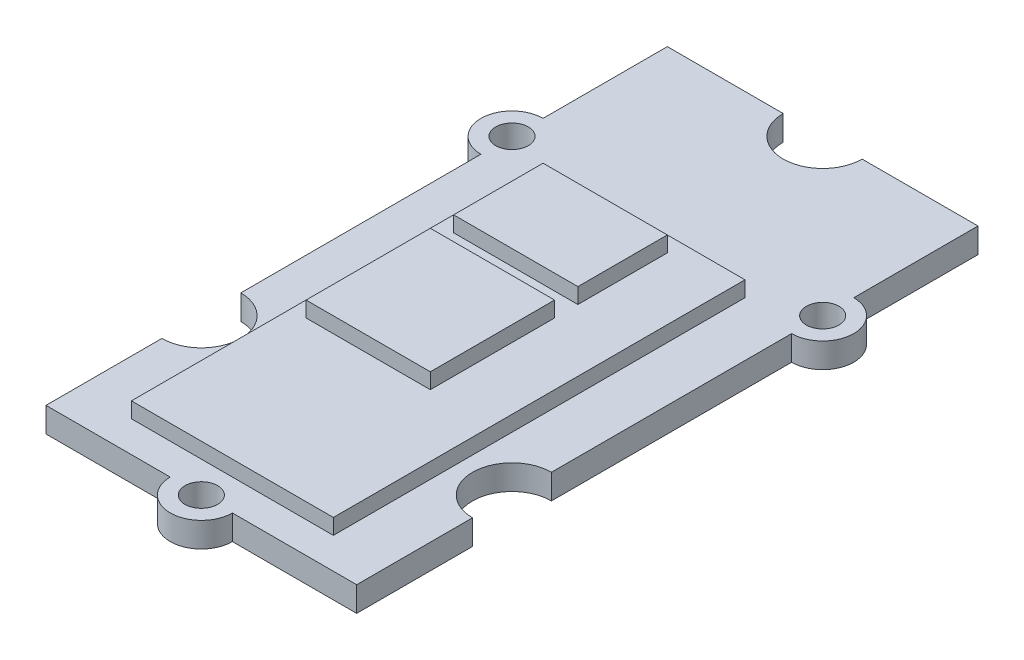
ISO-10303-21;
HEADER;
FILE_DESCRIPTION(('STEP AP214'),'2;1');
FILE_NAME('part.step','',(''),(''),'','','');
FILE_SCHEMA(('AUTOMOTIVE_DESIGN { 1 0 10303 214 1 1 1 1 }'));
ENDSEC;
DATA;
#1=APPLICATION_CONTEXT('core data for automotive mechanical design processes');
#2=APPLICATION_PROTOCOL_DEFINITION('international standard','automotive_design',2000,#1);
#3=PRODUCT_CONTEXT('',#1,'mechanical');
#4=PRODUCT('Part','Part','',(#3));
#5=PRODUCT_RELATED_PRODUCT_CATEGORY('part','',(#4));
#6=PRODUCT_DEFINITION_FORMATION('','',#4);
#7=PRODUCT_DEFINITION_CONTEXT('part definition',#1,'design');
#8=PRODUCT_DEFINITION('design','',#6,#7);
#9=PRODUCT_DEFINITION_SHAPE('','',#8);
#10=(LENGTH_UNIT() NAMED_UNIT(*) SI_UNIT(.MILLI.,.METRE.));
#11=(NAMED_UNIT(*) PLANE_ANGLE_UNIT() SI_UNIT($,.RADIAN.));
#12=(NAMED_UNIT(*) SI_UNIT($,.STERADIAN.) SOLID_ANGLE_UNIT());
#13=UNCERTAINTY_MEASURE_WITH_UNIT(LENGTH_MEASURE(1.E-05),#10,'distance_accuracy_value','');
#14=(GEOMETRIC_REPRESENTATION_CONTEXT(3) GLOBAL_UNCERTAINTY_ASSIGNED_CONTEXT((#13)) GLOBAL_UNIT_ASSIGNED_CONTEXT((#10,
#11,#12)) REPRESENTATION_CONTEXT('',''));
#15=CARTESIAN_POINT('',(0.,0.,0.));
#16=DIRECTION('',(0.,0.,1.));
#17=DIRECTION('',(1.,0.,0.));
#18=AXIS2_PLACEMENT_3D('',#15,#16,#17);
#19=CARTESIAN_POINT('',(0.,2.6,0.));
#20=DIRECTION('',(0.,1.,0.));
#21=DIRECTION('',(0.,0.,1.));
#22=AXIS2_PLACEMENT_3D('',#19,#20,#21);
#23=PLANE('',#22);
#24=DIRECTION('',(0.,0.,-1.));
#25=VECTOR('',#24,1.);
#26=CARTESIAN_POINT('',(6.5,2.6,1.5));
#27=LINE('',#26,#25);
#28=CARTESIAN_POINT('',(6.5,2.6,28.));
#29=VERTEX_POINT('',#28);
#30=CARTESIAN_POINT('',(6.5,2.6,1.5));
#31=VERTEX_POINT('',#30);
#32=EDGE_CURVE('E278',#29,#31,#27,.T.);
#33=ORIENTED_EDGE('',*,*,#32,.T.);
#34=DIRECTION('',(-1.,0.,0.));
#35=VECTOR('',#34,1.);
#36=CARTESIAN_POINT('',(-6.5,2.6,1.5));
#37=LINE('',#36,#35);
#38=CARTESIAN_POINT('',(-6.5,2.6,1.5));
#39=VERTEX_POINT('',#38);
#40=EDGE_CURVE('E281',#31,#39,#37,.T.);
#41=ORIENTED_EDGE('',*,*,#40,.T.);
#42=DIRECTION('',(0.,0.,1.));
#43=VECTOR('',#42,1.);
#44=CARTESIAN_POINT('',(-6.5,2.6,1.5));
#45=LINE('',#44,#43);
#46=CARTESIAN_POINT('',(-6.5,2.6,28.));
#47=VERTEX_POINT('',#46);
#48=EDGE_CURVE('E284',#39,#47,#45,.T.);
#49=ORIENTED_EDGE('',*,*,#48,.T.);
#50=DIRECTION('',(1.,0.,0.));
#51=VECTOR('',#50,1.);
#52=CARTESIAN_POINT('',(-6.5,2.6,28.));
#53=LINE('',#52,#51);
#54=EDGE_CURVE('E286',#47,#29,#53,.T.);
#55=ORIENTED_EDGE('',*,*,#54,.T.);
#56=EDGE_LOOP('',(#33,#41,#49,#55));
#57=FACE_BOUND('',#56,.T.);
#58=DIRECTION('',(1.,0.,0.));
#59=VECTOR('',#58,1.);
#60=CARTESIAN_POINT('',(-5.5,2.6,8.25839974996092));
#61=LINE('',#60,#59);
#62=CARTESIAN_POINT('',(-5.5,2.6,8.25839974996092));
#63=VERTEX_POINT('',#62);
#64=CARTESIAN_POINT('',(2.5,2.6,8.25839974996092));
#65=VERTEX_POINT('',#64);
#66=EDGE_CURVE('E249',#63,#65,#61,.T.);
#67=ORIENTED_EDGE('',*,*,#66,.F.);
#68=DIRECTION('',(0.,0.,1.));
#69=VECTOR('',#68,1.);
#70=CARTESIAN_POINT('',(-5.5,2.6,2.5));
#71=LINE('',#70,#69);
#72=CARTESIAN_POINT('',(-5.5,2.6,2.5));
#73=VERTEX_POINT('',#72);
#74=EDGE_CURVE('E246',#73,#63,#71,.T.);
#75=ORIENTED_EDGE('',*,*,#74,.F.);
#76=DIRECTION('',(-1.,0.,0.));
#77=VECTOR('',#76,1.);
#78=CARTESIAN_POINT('',(-5.5,2.6,2.5));
#79=LINE('',#78,#77);
#80=CARTESIAN_POINT('',(2.5,2.6,2.5));
#81=VERTEX_POINT('',#80);
#82=EDGE_CURVE('E258',#81,#73,#79,.T.);
#83=ORIENTED_EDGE('',*,*,#82,.F.);
#84=DIRECTION('',(0.,0.,-1.));
#85=VECTOR('',#84,1.);
#86=CARTESIAN_POINT('',(2.5,2.6,2.5));
#87=LINE('',#86,#85);
#88=EDGE_CURVE('E266',#65,#81,#87,.T.);
#89=ORIENTED_EDGE('',*,*,#88,.F.);
#90=EDGE_LOOP('',(#67,#75,#83,#89));
#91=FACE_BOUND('',#90,.T.);
#92=DIRECTION('',(1.,0.,0.));
#93=VECTOR('',#92,1.);
#94=CARTESIAN_POINT('',(-5.5,2.6,17.7583997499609));
#95=LINE('',#94,#93);
#96=CARTESIAN_POINT('',(-5.5,2.6,17.7583997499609));
#97=VERTEX_POINT('',#96);
#98=CARTESIAN_POINT('',(2.5,2.6,17.7583997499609));
#99=VERTEX_POINT('',#98);
#100=EDGE_CURVE('E766',#97,#99,#95,.T.);
#101=ORIENTED_EDGE('',*,*,#100,.F.);
#102=DIRECTION('',(0.,0.,1.));
#103=VECTOR('',#102,1.);
#104=CARTESIAN_POINT('',(-5.5,2.6,9.75839974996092));
#105=LINE('',#104,#103);
#106=CARTESIAN_POINT('',(-5.5,2.6,9.75839974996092));
#107=VERTEX_POINT('',#106);
#108=EDGE_CURVE('E244',#107,#97,#105,.T.);
#109=ORIENTED_EDGE('',*,*,#108,.F.);
#110=DIRECTION('',(-1.,0.,0.));
#111=VECTOR('',#110,1.);
#112=CARTESIAN_POINT('',(-5.5,2.6,9.75839974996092));
#113=LINE('',#112,#111);
#114=CARTESIAN_POINT('',(2.5,2.6,9.75839974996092));
#115=VERTEX_POINT('',#114);
#116=EDGE_CURVE('E240',#115,#107,#113,.T.);
#117=ORIENTED_EDGE('',*,*,#116,.F.);
#118=DIRECTION('',(0.,0.,-1.));
#119=VECTOR('',#118,1.);
#120=CARTESIAN_POINT('',(2.5,2.6,9.75839974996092));
#121=LINE('',#120,#119);
#122=EDGE_CURVE('E763',#99,#115,#121,.T.);
#123=ORIENTED_EDGE('',*,*,#122,.F.);
#124=EDGE_LOOP('',(#101,#109,#117,#123));
#125=FACE_BOUND('',#124,.T.);
#126=ADVANCED_FACE('F35',(#57,#91,#125),#23,.T.);
#127=CARTESIAN_POINT('',(-10.,1.6,0.));
#128=DIRECTION('',(0.,-1.,0.));
#129=DIRECTION('',(0.,0.,-1.));
#130=AXIS2_PLACEMENT_3D('',#127,#128,#129);
#131=PLANE('',#130);
#132=CARTESIAN_POINT('',(0.,1.6,30.));
#133=DIRECTION('',(0.,1.,0.));
#134=DIRECTION('',(0.,0.,1.));
#135=AXIS2_PLACEMENT_3D('',#132,#133,#134);
#136=CIRCLE('',#135,1.05);
#137=CARTESIAN_POINT('',(0.,1.6,31.05));
#138=VERTEX_POINT('',#137);
#139=EDGE_CURVE('E311',#138,#138,#136,.T.);
#140=ORIENTED_EDGE('',*,*,#139,.F.);
#141=EDGE_LOOP('',(#140));
#142=FACE_BOUND('',#141,.T.);
#143=CARTESIAN_POINT('',(-10.,1.6,0.));
#144=DIRECTION('',(0.,1.,0.));
#145=DIRECTION('',(0.,0.,-1.));
#146=AXIS2_PLACEMENT_3D('',#143,#144,#145);
#147=CIRCLE('',#146,1.05);
#148=CARTESIAN_POINT('',(-10.,1.6,-1.04999999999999));
#149=VERTEX_POINT('',#148);
#150=EDGE_CURVE('E317',#149,#149,#147,.T.);
#151=ORIENTED_EDGE('',*,*,#150,.F.);
#152=EDGE_LOOP('',(#151));
#153=FACE_BOUND('',#152,.T.);
#154=CARTESIAN_POINT('',(10.,1.6,0.));
#155=DIRECTION('',(0.,1.,0.));
#156=DIRECTION('',(0.,0.,1.));
#157=AXIS2_PLACEMENT_3D('',#154,#155,#156);
#158=CIRCLE('',#157,1.05);
#159=CARTESIAN_POINT('',(10.,1.6,1.05000000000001));
#160=VERTEX_POINT('',#159);
#161=EDGE_CURVE('E323',#160,#160,#158,.T.);
#162=ORIENTED_EDGE('',*,*,#161,.F.);
#163=EDGE_LOOP('',(#162));
#164=FACE_BOUND('',#163,.T.);
#165=DIRECTION('',(0.,0.,1.));
#166=VECTOR('',#165,1.);
#167=CARTESIAN_POINT('',(-10.,1.6,-9.99999999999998));
#168=LINE('',#167,#166);
#169=CARTESIAN_POINT('',(-10.,1.6,-9.99999999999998));
#170=VERTEX_POINT('',#169);
#171=CARTESIAN_POINT('',(-10.,1.6,-1.99999999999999));
#172=VERTEX_POINT('',#171);
#173=EDGE_CURVE('E329',#170,#172,#168,.T.);
#174=ORIENTED_EDGE('',*,*,#173,.T.);
#175=CARTESIAN_POINT('',(-10.,1.6,0.));
#176=DIRECTION('',(0.,1.,0.));
#177=DIRECTION('',(0.,0.,-1.));
#178=AXIS2_PLACEMENT_3D('',#175,#176,#177);
#179=CIRCLE('',#178,2.);
#180=CARTESIAN_POINT('',(-10.,1.6,2.00000000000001));
#181=VERTEX_POINT('',#180);
#182=EDGE_CURVE('E332',#172,#181,#179,.T.);
#183=ORIENTED_EDGE('',*,*,#182,.T.);
#184=DIRECTION('',(0.,0.,1.));
#185=VECTOR('',#184,1.);
#186=CARTESIAN_POINT('',(-10.,1.6,2.00000000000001));
#187=LINE('',#186,#185);
#188=CARTESIAN_POINT('',(-10.,1.6,17.46));
#189=VERTEX_POINT('',#188);
#190=EDGE_CURVE('E335',#181,#189,#187,.T.);
#191=ORIENTED_EDGE('',*,*,#190,.T.);
#192=CARTESIAN_POINT('',(-10.,1.6,20.));
#193=DIRECTION('',(0.,-1.,0.));
#194=DIRECTION('',(0.,0.,-1.));
#195=AXIS2_PLACEMENT_3D('',#192,#193,#194);
#196=CIRCLE('',#195,2.54);
#197=CARTESIAN_POINT('',(-10.,1.6,22.54));
#198=VERTEX_POINT('',#197);
#199=EDGE_CURVE('E337',#189,#198,#196,.T.);
#200=ORIENTED_EDGE('',*,*,#199,.T.);
#201=DIRECTION('',(0.,0.,1.));
#202=VECTOR('',#201,1.);
#203=CARTESIAN_POINT('',(-10.,1.6,22.54));
#204=LINE('',#203,#202);
#205=CARTESIAN_POINT('',(-10.,1.6,30.));
#206=VERTEX_POINT('',#205);
#207=EDGE_CURVE('E339',#198,#206,#204,.T.);
#208=ORIENTED_EDGE('',*,*,#207,.T.);
#209=DIRECTION('',(1.,0.,0.));
#210=VECTOR('',#209,1.);
#211=CARTESIAN_POINT('',(-10.,1.6,30.));
#212=LINE('',#211,#210);
#213=CARTESIAN_POINT('',(-2.,1.6,30.));
#214=VERTEX_POINT('',#213);
#215=EDGE_CURVE('E341',#206,#214,#212,.T.);
#216=ORIENTED_EDGE('',*,*,#215,.T.);
#217=CARTESIAN_POINT('',(0.,1.6,30.));
#218=DIRECTION('',(0.,1.,0.));
#219=DIRECTION('',(0.,0.,1.));
#220=AXIS2_PLACEMENT_3D('',#217,#218,#219);
#221=CIRCLE('',#220,2.);
#222=CARTESIAN_POINT('',(2.,1.6,30.));
#223=VERTEX_POINT('',#222);
#224=EDGE_CURVE('E343',#214,#223,#221,.T.);
#225=ORIENTED_EDGE('',*,*,#224,.T.);
#226=DIRECTION('',(1.,0.,0.));
#227=VECTOR('',#226,1.);
#228=CARTESIAN_POINT('',(2.,1.6,30.));
#229=LINE('',#228,#227);
#230=CARTESIAN_POINT('',(10.,1.6,30.));
#231=VERTEX_POINT('',#230);
#232=EDGE_CURVE('E345',#223,#231,#229,.T.);
#233=ORIENTED_EDGE('',*,*,#232,.T.);
#234=DIRECTION('',(0.,0.,-1.));
#235=VECTOR('',#234,1.);
#236=CARTESIAN_POINT('',(10.,1.6,22.54));
#237=LINE('',#236,#235);
#238=CARTESIAN_POINT('',(10.,1.6,22.54));
#239=VERTEX_POINT('',#238);
#240=EDGE_CURVE('E347',#231,#239,#237,.T.);
#241=ORIENTED_EDGE('',*,*,#240,.T.);
#242=CARTESIAN_POINT('',(10.,1.6,20.));
#243=DIRECTION('',(0.,-1.,0.));
#244=DIRECTION('',(0.,0.,1.));
#245=AXIS2_PLACEMENT_3D('',#242,#243,#244);
#246=CIRCLE('',#245,2.54);
#247=CARTESIAN_POINT('',(10.,1.6,17.46));
#248=VERTEX_POINT('',#247);
#249=EDGE_CURVE('E349',#239,#248,#246,.T.);
#250=ORIENTED_EDGE('',*,*,#249,.T.);
#251=DIRECTION('',(0.,0.,-1.));
#252=VECTOR('',#251,1.);
#253=CARTESIAN_POINT('',(10.,1.6,2.00000000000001));
#254=LINE('',#253,#252);
#255=CARTESIAN_POINT('',(10.,1.6,2.00000000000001));
#256=VERTEX_POINT('',#255);
#257=EDGE_CURVE('E351',#248,#256,#254,.T.);
#258=ORIENTED_EDGE('',*,*,#257,.T.);
#259=CARTESIAN_POINT('',(10.,1.6,0.));
#260=DIRECTION('',(0.,1.,0.));
#261=DIRECTION('',(0.,0.,1.));
#262=AXIS2_PLACEMENT_3D('',#259,#260,#261);
#263=CIRCLE('',#262,2.);
#264=CARTESIAN_POINT('',(10.,1.6,-1.99999999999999));
#265=VERTEX_POINT('',#264);
#266=EDGE_CURVE('E353',#256,#265,#263,.T.);
#267=ORIENTED_EDGE('',*,*,#266,.T.);
#268=DIRECTION('',(0.,0.,-1.));
#269=VECTOR('',#268,1.);
#270=CARTESIAN_POINT('',(10.,1.6,-9.99999999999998));
#271=LINE('',#270,#269);
#272=CARTESIAN_POINT('',(10.,1.6,-9.99999999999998));
#273=VERTEX_POINT('',#272);
#274=EDGE_CURVE('E355',#265,#273,#271,.T.);
#275=ORIENTED_EDGE('',*,*,#274,.T.);
#276=DIRECTION('',(-1.,0.,0.));
#277=VECTOR('',#276,1.);
#278=CARTESIAN_POINT('',(2.54,1.6,-9.99999999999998));
#279=LINE('',#278,#277);
#280=CARTESIAN_POINT('',(2.54,1.6,-9.99999999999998));
#281=VERTEX_POINT('',#280);
#282=EDGE_CURVE('E357',#273,#281,#279,.T.);
#283=ORIENTED_EDGE('',*,*,#282,.T.);
#284=CARTESIAN_POINT('',(0.,1.6,-9.99999999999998));
#285=DIRECTION('',(0.,-1.,0.));
#286=DIRECTION('',(0.,0.,1.));
#287=AXIS2_PLACEMENT_3D('',#284,#285,#286);
#288=CIRCLE('',#287,2.54);
#289=CARTESIAN_POINT('',(-2.54,1.6,-9.99999999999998));
#290=VERTEX_POINT('',#289);
#291=EDGE_CURVE('E359',#281,#290,#288,.T.);
#292=ORIENTED_EDGE('',*,*,#291,.T.);
#293=DIRECTION('',(-1.,0.,0.));
#294=VECTOR('',#293,1.);
#295=CARTESIAN_POINT('',(-10.,1.6,-9.99999999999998));
#296=LINE('',#295,#294);
#297=EDGE_CURVE('E361',#290,#170,#296,.T.);
#298=ORIENTED_EDGE('',*,*,#297,.T.);
#299=EDGE_LOOP('',(#174,#183,#191,#200,#208,#216,#225,#233,#241,#250,#258,#267,#275,#283,#292,#298));
#300=FACE_BOUND('',#299,.T.);
#301=DIRECTION('',(0.,0.,-1.));
#302=VECTOR('',#301,1.);
#303=CARTESIAN_POINT('',(6.5,1.6,1.5));
#304=LINE('',#303,#302);
#305=CARTESIAN_POINT('',(6.5,1.6,28.));
#306=VERTEX_POINT('',#305);
#307=CARTESIAN_POINT('',(6.5,1.6,1.5));
#308=VERTEX_POINT('',#307);
#309=EDGE_CURVE('E277',#306,#308,#304,.T.);
#310=ORIENTED_EDGE('',*,*,#309,.F.);
#311=DIRECTION('',(1.,0.,0.));
#312=VECTOR('',#311,1.);
#313=CARTESIAN_POINT('',(-6.5,1.6,28.));
#314=LINE('',#313,#312);
#315=CARTESIAN_POINT('',(-6.5,1.6,28.));
#316=VERTEX_POINT('',#315);
#317=EDGE_CURVE('E282',#316,#306,#314,.T.);
#318=ORIENTED_EDGE('',*,*,#317,.F.);
#319=DIRECTION('',(0.,0.,1.));
#320=VECTOR('',#319,1.);
#321=CARTESIAN_POINT('',(-6.5,1.6,1.5));
#322=LINE('',#321,#320);
#323=CARTESIAN_POINT('',(-6.5,1.6,1.5));
#324=VERTEX_POINT('',#323);
#325=EDGE_CURVE('E294',#324,#316,#322,.T.);
#326=ORIENTED_EDGE('',*,*,#325,.F.);
#327=DIRECTION('',(-1.,0.,0.));
#328=VECTOR('',#327,1.);
#329=CARTESIAN_POINT('',(-6.5,1.6,1.5));
#330=LINE('',#329,#328);
#331=EDGE_CURVE('E291',#308,#324,#330,.T.);
#332=ORIENTED_EDGE('',*,*,#331,.F.);
#333=EDGE_LOOP('',(#310,#318,#326,#332));
#334=FACE_BOUND('',#333,.T.);
#335=ADVANCED_FACE('F460',(#142,#153,#164,#300,#334),#131,.F.);
#336=CARTESIAN_POINT('',(-10.,0.,0.));
#337=DIRECTION('',(0.,-1.,0.));
#338=DIRECTION('',(0.,0.,-1.));
#339=AXIS2_PLACEMENT_3D('',#336,#337,#338);
#340=PLANE('',#339);
#341=CARTESIAN_POINT('',(-10.,0.,0.));
#342=DIRECTION('',(0.,1.,0.));
#343=DIRECTION('',(0.,0.,-1.));
#344=AXIS2_PLACEMENT_3D('',#341,#342,#343);
#345=CIRCLE('',#344,1.05);
#346=CARTESIAN_POINT('',(-10.,0.,-1.04999999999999));
#347=VERTEX_POINT('',#346);
#348=EDGE_CURVE('E314',#347,#347,#345,.T.);
#349=ORIENTED_EDGE('',*,*,#348,.T.);
#350=EDGE_LOOP('',(#349));
#351=FACE_BOUND('',#350,.T.);
#352=DIRECTION('',(0.,0.,1.));
#353=VECTOR('',#352,1.);
#354=CARTESIAN_POINT('',(-10.,0.,-9.99999999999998));
#355=LINE('',#354,#353);
#356=CARTESIAN_POINT('',(-10.,0.,-9.99999999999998));
#357=VERTEX_POINT('',#356);
#358=CARTESIAN_POINT('',(-10.,0.,-1.99999999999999));
#359=VERTEX_POINT('',#358);
#360=EDGE_CURVE('E326',#357,#359,#355,.T.);
#361=ORIENTED_EDGE('',*,*,#360,.F.);
#362=DIRECTION('',(-1.,0.,0.));
#363=VECTOR('',#362,1.);
#364=CARTESIAN_POINT('',(-10.,0.,-9.99999999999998));
#365=LINE('',#364,#363);
#366=CARTESIAN_POINT('',(-2.54,0.,-9.99999999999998));
#367=VERTEX_POINT('',#366);
#368=EDGE_CURVE('E333',#367,#357,#365,.T.);
#369=ORIENTED_EDGE('',*,*,#368,.F.);
#370=CARTESIAN_POINT('',(0.,0.,-9.99999999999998));
#371=DIRECTION('',(0.,-1.,0.));
#372=DIRECTION('',(0.,0.,1.));
#373=AXIS2_PLACEMENT_3D('',#370,#371,#372);
#374=CIRCLE('',#373,2.54);
#375=CARTESIAN_POINT('',(2.54,0.,-9.99999999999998));
#376=VERTEX_POINT('',#375);
#377=EDGE_CURVE('E392',#376,#367,#374,.T.);
#378=ORIENTED_EDGE('',*,*,#377,.F.);
#379=DIRECTION('',(-1.,0.,0.));
#380=VECTOR('',#379,1.);
#381=CARTESIAN_POINT('',(2.54,0.,-9.99999999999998));
#382=LINE('',#381,#380);
#383=CARTESIAN_POINT('',(10.,0.,-9.99999999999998));
#384=VERTEX_POINT('',#383);
#385=EDGE_CURVE('E390',#384,#376,#382,.T.);
#386=ORIENTED_EDGE('',*,*,#385,.F.);
#387=DIRECTION('',(0.,0.,-1.));
#388=VECTOR('',#387,1.);
#389=CARTESIAN_POINT('',(10.,0.,-9.99999999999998));
#390=LINE('',#389,#388);
#391=CARTESIAN_POINT('',(10.,0.,-1.99999999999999));
#392=VERTEX_POINT('',#391);
#393=EDGE_CURVE('E388',#392,#384,#390,.T.);
#394=ORIENTED_EDGE('',*,*,#393,.F.);
#395=CARTESIAN_POINT('',(10.,0.,0.));
#396=DIRECTION('',(0.,1.,0.));
#397=DIRECTION('',(0.,0.,1.));
#398=AXIS2_PLACEMENT_3D('',#395,#396,#397);
#399=CIRCLE('',#398,2.);
#400=CARTESIAN_POINT('',(10.,0.,2.00000000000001));
#401=VERTEX_POINT('',#400);
#402=EDGE_CURVE('E386',#401,#392,#399,.T.);
#403=ORIENTED_EDGE('',*,*,#402,.F.);
#404=DIRECTION('',(0.,0.,-1.));
#405=VECTOR('',#404,1.);
#406=CARTESIAN_POINT('',(10.,0.,2.00000000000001));
#407=LINE('',#406,#405);
#408=CARTESIAN_POINT('',(10.,0.,17.46));
#409=VERTEX_POINT('',#408);
#410=EDGE_CURVE('E384',#409,#401,#407,.T.);
#411=ORIENTED_EDGE('',*,*,#410,.F.);
#412=CARTESIAN_POINT('',(10.,0.,20.));
#413=DIRECTION('',(0.,-1.,0.));
#414=DIRECTION('',(0.,0.,1.));
#415=AXIS2_PLACEMENT_3D('',#412,#413,#414);
#416=CIRCLE('',#415,2.54);
#417=CARTESIAN_POINT('',(10.,0.,22.54));
#418=VERTEX_POINT('',#417);
#419=EDGE_CURVE('E382',#418,#409,#416,.T.);
#420=ORIENTED_EDGE('',*,*,#419,.F.);
#421=DIRECTION('',(0.,0.,-1.));
#422=VECTOR('',#421,1.);
#423=CARTESIAN_POINT('',(10.,0.,22.54));
#424=LINE('',#423,#422);
#425=CARTESIAN_POINT('',(10.,0.,30.));
#426=VERTEX_POINT('',#425);
#427=EDGE_CURVE('E380',#426,#418,#424,.T.);
#428=ORIENTED_EDGE('',*,*,#427,.F.);
#429=DIRECTION('',(1.,0.,0.));
#430=VECTOR('',#429,1.);
#431=CARTESIAN_POINT('',(2.,0.,30.));
#432=LINE('',#431,#430);
#433=CARTESIAN_POINT('',(2.,0.,30.));
#434=VERTEX_POINT('',#433);
#435=EDGE_CURVE('E378',#434,#426,#432,.T.);
#436=ORIENTED_EDGE('',*,*,#435,.F.);
#437=CARTESIAN_POINT('',(0.,0.,30.));
#438=DIRECTION('',(0.,1.,0.));
#439=DIRECTION('',(0.,0.,1.));
#440=AXIS2_PLACEMENT_3D('',#437,#438,#439);
#441=CIRCLE('',#440,2.);
#442=CARTESIAN_POINT('',(-2.,0.,30.));
#443=VERTEX_POINT('',#442);
#444=EDGE_CURVE('E376',#443,#434,#441,.T.);
#445=ORIENTED_EDGE('',*,*,#444,.F.);
#446=DIRECTION('',(1.,0.,0.));
#447=VECTOR('',#446,1.);
#448=CARTESIAN_POINT('',(-10.,0.,30.));
#449=LINE('',#448,#447);
#450=CARTESIAN_POINT('',(-10.,0.,30.));
#451=VERTEX_POINT('',#450);
#452=EDGE_CURVE('E374',#451,#443,#449,.T.);
#453=ORIENTED_EDGE('',*,*,#452,.F.);
#454=DIRECTION('',(0.,0.,1.));
#455=VECTOR('',#454,1.);
#456=CARTESIAN_POINT('',(-10.,0.,22.54));
#457=LINE('',#456,#455);
#458=CARTESIAN_POINT('',(-10.,0.,22.54));
#459=VERTEX_POINT('',#458);
#460=EDGE_CURVE('E372',#459,#451,#457,.T.);
#461=ORIENTED_EDGE('',*,*,#460,.F.);
#462=CARTESIAN_POINT('',(-10.,0.,20.));
#463=DIRECTION('',(0.,-1.,0.));
#464=DIRECTION('',(0.,0.,-1.));
#465=AXIS2_PLACEMENT_3D('',#462,#463,#464);
#466=CIRCLE('',#465,2.54);
#467=CARTESIAN_POINT('',(-10.,0.,17.46));
#468=VERTEX_POINT('',#467);
#469=EDGE_CURVE('E370',#468,#459,#466,.T.);
#470=ORIENTED_EDGE('',*,*,#469,.F.);
#471=DIRECTION('',(0.,0.,1.));
#472=VECTOR('',#471,1.);
#473=CARTESIAN_POINT('',(-10.,0.,2.00000000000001));
#474=LINE('',#473,#472);
#475=CARTESIAN_POINT('',(-10.,0.,2.00000000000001));
#476=VERTEX_POINT('',#475);
#477=EDGE_CURVE('E368',#476,#468,#474,.T.);
#478=ORIENTED_EDGE('',*,*,#477,.F.);
#479=CARTESIAN_POINT('',(-10.,0.,0.));
#480=DIRECTION('',(0.,1.,0.));
#481=DIRECTION('',(0.,0.,-1.));
#482=AXIS2_PLACEMENT_3D('',#479,#480,#481);
#483=CIRCLE('',#482,2.);
#484=EDGE_CURVE('E366',#359,#476,#483,.T.);
#485=ORIENTED_EDGE('',*,*,#484,.F.);
#486=EDGE_LOOP('',(#361,#369,#378,#386,#394,#403,#411,#420,#428,#436,#445,#453,#461,#470,#478,#485));
#487=FACE_BOUND('',#486,.T.);
#488=CARTESIAN_POINT('',(10.,0.,0.));
#489=DIRECTION('',(0.,1.,0.));
#490=DIRECTION('',(0.,0.,1.));
#491=AXIS2_PLACEMENT_3D('',#488,#489,#490);
#492=CIRCLE('',#491,1.05);
#493=CARTESIAN_POINT('',(10.,0.,1.05000000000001));
#494=VERTEX_POINT('',#493);
#495=EDGE_CURVE('E320',#494,#494,#492,.T.);
#496=ORIENTED_EDGE('',*,*,#495,.T.);
#497=EDGE_LOOP('',(#496));
#498=FACE_BOUND('',#497,.T.);
#499=CARTESIAN_POINT('',(0.,0.,30.));
#500=DIRECTION('',(0.,1.,0.));
#501=DIRECTION('',(0.,0.,1.));
#502=AXIS2_PLACEMENT_3D('',#499,#500,#501);
#503=CIRCLE('',#502,1.05);
#504=CARTESIAN_POINT('',(0.,0.,31.05));
#505=VERTEX_POINT('',#504);
#506=EDGE_CURVE('E310',#505,#505,#503,.T.);
#507=ORIENTED_EDGE('',*,*,#506,.T.);
#508=EDGE_LOOP('',(#507));
#509=FACE_BOUND('',#508,.T.);
#510=ADVANCED_FACE('F446',(#351,#487,#498,#509),#340,.T.);
#511=CARTESIAN_POINT('',(-10.,1.6,-9.99999999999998));
#512=DIRECTION('',(1.,0.,0.));
#513=DIRECTION('',(0.,0.,-1.));
#514=AXIS2_PLACEMENT_3D('',#511,#512,#513);
#515=PLANE('',#514);
#516=ORIENTED_EDGE('',*,*,#360,.T.);
#517=DIRECTION('',(0.,-1.,0.));
#518=VECTOR('',#517,1.);
#519=CARTESIAN_POINT('',(-10.,1.6,-1.99999999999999));
#520=LINE('',#519,#518);
#521=EDGE_CURVE('E11',#172,#359,#520,.T.);
#522=ORIENTED_EDGE('',*,*,#521,.F.);
#523=ORIENTED_EDGE('',*,*,#173,.F.);
#524=DIRECTION('',(0.,-1.,0.));
#525=VECTOR('',#524,1.);
#526=CARTESIAN_POINT('',(-10.,1.6,-9.99999999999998));
#527=LINE('',#526,#525);
#528=EDGE_CURVE('E363',#170,#357,#527,.T.);
#529=ORIENTED_EDGE('',*,*,#528,.T.);
#530=EDGE_LOOP('',(#516,#522,#523,#529));
#531=FACE_BOUND('',#530,.T.);
#532=ADVANCED_FACE('F37',(#531),#515,.F.);
#533=CARTESIAN_POINT('',(-10.,1.6,0.));
#534=DIRECTION('',(0.,-1.,0.));
#535=DIRECTION('',(0.,0.,-1.));
#536=AXIS2_PLACEMENT_3D('',#533,#534,#535);
#537=CYLINDRICAL_SURFACE('',#536,2.);
#538=ORIENTED_EDGE('',*,*,#484,.T.);
#539=DIRECTION('',(0.,-1.,0.));
#540=VECTOR('',#539,1.);
#541=CARTESIAN_POINT('',(-10.,1.6,2.00000000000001));
#542=LINE('',#541,#540);
#543=EDGE_CURVE('E43',#181,#476,#542,.T.);
#544=ORIENTED_EDGE('',*,*,#543,.F.);
#545=ORIENTED_EDGE('',*,*,#182,.F.);
#546=ORIENTED_EDGE('',*,*,#521,.T.);
#547=EDGE_LOOP('',(#538,#544,#545,#546));
#548=FACE_BOUND('',#547,.T.);
#549=ADVANCED_FACE('F465',(#548),#537,.T.);
#550=CARTESIAN_POINT('',(-10.,1.6,2.00000000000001));
#551=DIRECTION('',(1.,0.,0.));
#552=DIRECTION('',(0.,0.,-1.));
#553=AXIS2_PLACEMENT_3D('',#550,#551,#552);
#554=PLANE('',#553);
#555=ORIENTED_EDGE('',*,*,#477,.T.);
#556=DIRECTION('',(0.,-1.,0.));
#557=VECTOR('',#556,1.);
#558=CARTESIAN_POINT('',(-10.,1.6,17.46));
#559=LINE('',#558,#557);
#560=EDGE_CURVE('E433',#189,#468,#559,.T.);
#561=ORIENTED_EDGE('',*,*,#560,.F.);
#562=ORIENTED_EDGE('',*,*,#190,.F.);
#563=ORIENTED_EDGE('',*,*,#543,.T.);
#564=EDGE_LOOP('',(#555,#561,#562,#563));
#565=FACE_BOUND('',#564,.T.);
#566=ADVANCED_FACE('F440',(#565),#554,.F.);
#567=CARTESIAN_POINT('',(-10.,1.6,20.));
#568=DIRECTION('',(0.,-1.,0.));
#569=DIRECTION('',(0.,0.,-1.));
#570=AXIS2_PLACEMENT_3D('',#567,#568,#569);
#571=CYLINDRICAL_SURFACE('',#570,2.54);
#572=ORIENTED_EDGE('',*,*,#469,.T.);
#573=DIRECTION('',(0.,-1.,0.));
#574=VECTOR('',#573,1.);
#575=CARTESIAN_POINT('',(-10.,1.6,22.54));
#576=LINE('',#575,#574);
#577=EDGE_CURVE('E430',#198,#459,#576,.T.);
#578=ORIENTED_EDGE('',*,*,#577,.F.);
#579=ORIENTED_EDGE('',*,*,#199,.F.);
#580=ORIENTED_EDGE('',*,*,#560,.T.);
#581=EDGE_LOOP('',(#572,#578,#579,#580));
#582=FACE_BOUND('',#581,.T.);
#583=ADVANCED_FACE('F452',(#582),#571,.F.);
#584=CARTESIAN_POINT('',(-10.,1.6,22.54));
#585=DIRECTION('',(1.,0.,0.));
#586=DIRECTION('',(0.,0.,-1.));
#587=AXIS2_PLACEMENT_3D('',#584,#585,#586);
#588=PLANE('',#587);
#589=ORIENTED_EDGE('',*,*,#460,.T.);
#590=DIRECTION('',(0.,-1.,0.));
#591=VECTOR('',#590,1.);
#592=CARTESIAN_POINT('',(-10.,1.6,30.));
#593=LINE('',#592,#591);
#594=EDGE_CURVE('E427',#206,#451,#593,.T.);
#595=ORIENTED_EDGE('',*,*,#594,.F.);
#596=ORIENTED_EDGE('',*,*,#207,.F.);
#597=ORIENTED_EDGE('',*,*,#577,.T.);
#598=EDGE_LOOP('',(#589,#595,#596,#597));
#599=FACE_BOUND('',#598,.T.);
#600=ADVANCED_FACE('F456',(#599),#588,.F.);
#601=CARTESIAN_POINT('',(-10.,1.6,30.));
#602=DIRECTION('',(0.,0.,-1.));
#603=DIRECTION('',(-1.,0.,0.));
#604=AXIS2_PLACEMENT_3D('',#601,#602,#603);
#605=PLANE('',#604);
#606=ORIENTED_EDGE('',*,*,#452,.T.);
#607=DIRECTION('',(0.,-1.,0.));
#608=VECTOR('',#607,1.);
#609=CARTESIAN_POINT('',(-2.,1.6,30.));
#610=LINE('',#609,#608);
#611=EDGE_CURVE('E424',#214,#443,#610,.T.);
#612=ORIENTED_EDGE('',*,*,#611,.F.);
#613=ORIENTED_EDGE('',*,*,#215,.F.);
#614=ORIENTED_EDGE('',*,*,#594,.T.);
#615=EDGE_LOOP('',(#606,#612,#613,#614));
#616=FACE_BOUND('',#615,.T.);
#617=ADVANCED_FACE('F518',(#616),#605,.F.);
#618=CARTESIAN_POINT('',(0.,1.6,30.));
#619=DIRECTION('',(0.,-1.,0.));
#620=DIRECTION('',(0.,0.,-1.));
#621=AXIS2_PLACEMENT_3D('',#618,#619,#620);
#622=CYLINDRICAL_SURFACE('',#621,2.);
#623=ORIENTED_EDGE('',*,*,#444,.T.);
#624=DIRECTION('',(0.,-1.,0.));
#625=VECTOR('',#624,1.);
#626=CARTESIAN_POINT('',(2.,1.6,30.));
#627=LINE('',#626,#625);
#628=EDGE_CURVE('E421',#223,#434,#627,.T.);
#629=ORIENTED_EDGE('',*,*,#628,.F.);
#630=ORIENTED_EDGE('',*,*,#224,.F.);
#631=ORIENTED_EDGE('',*,*,#611,.T.);
#632=EDGE_LOOP('',(#623,#629,#630,#631));
#633=FACE_BOUND('',#632,.T.);
#634=ADVANCED_FACE('F515',(#633),#622,.T.);
#635=CARTESIAN_POINT('',(2.,1.6,30.));
#636=DIRECTION('',(0.,0.,-1.));
#637=DIRECTION('',(-1.,0.,0.));
#638=AXIS2_PLACEMENT_3D('',#635,#636,#637);
#639=PLANE('',#638);
#640=ORIENTED_EDGE('',*,*,#435,.T.);
#641=DIRECTION('',(0.,-1.,0.));
#642=VECTOR('',#641,1.);
#643=CARTESIAN_POINT('',(10.,1.6,30.));
#644=LINE('',#643,#642);
#645=EDGE_CURVE('E418',#231,#426,#644,.T.);
#646=ORIENTED_EDGE('',*,*,#645,.F.);
#647=ORIENTED_EDGE('',*,*,#232,.F.);
#648=ORIENTED_EDGE('',*,*,#628,.T.);
#649=EDGE_LOOP('',(#640,#646,#647,#648));
#650=FACE_BOUND('',#649,.T.);
#651=ADVANCED_FACE('F511',(#650),#639,.F.);
#652=CARTESIAN_POINT('',(10.,1.6,22.54));
#653=DIRECTION('',(-1.,0.,0.));
#654=DIRECTION('',(0.,0.,1.));
#655=AXIS2_PLACEMENT_3D('',#652,#653,#654);
#656=PLANE('',#655);
#657=ORIENTED_EDGE('',*,*,#427,.T.);
#658=DIRECTION('',(0.,-1.,0.));
#659=VECTOR('',#658,1.);
#660=CARTESIAN_POINT('',(10.,1.6,22.54));
#661=LINE('',#660,#659);
#662=EDGE_CURVE('E415',#239,#418,#661,.T.);
#663=ORIENTED_EDGE('',*,*,#662,.F.);
#664=ORIENTED_EDGE('',*,*,#240,.F.);
#665=ORIENTED_EDGE('',*,*,#645,.T.);
#666=EDGE_LOOP('',(#657,#663,#664,#665));
#667=FACE_BOUND('',#666,.T.);
#668=ADVANCED_FACE('F507',(#667),#656,.F.);
#669=CARTESIAN_POINT('',(10.,1.6,20.));
#670=DIRECTION('',(0.,-1.,0.));
#671=DIRECTION('',(0.,0.,-1.));
#672=AXIS2_PLACEMENT_3D('',#669,#670,#671);
#673=CYLINDRICAL_SURFACE('',#672,2.54);
#674=ORIENTED_EDGE('',*,*,#419,.T.);
#675=DIRECTION('',(0.,-1.,0.));
#676=VECTOR('',#675,1.);
#677=CARTESIAN_POINT('',(10.,1.6,17.46));
#678=LINE('',#677,#676);
#679=EDGE_CURVE('E412',#248,#409,#678,.T.);
#680=ORIENTED_EDGE('',*,*,#679,.F.);
#681=ORIENTED_EDGE('',*,*,#249,.F.);
#682=ORIENTED_EDGE('',*,*,#662,.T.);
#683=EDGE_LOOP('',(#674,#680,#681,#682));
#684=FACE_BOUND('',#683,.T.);
#685=ADVANCED_FACE('F502',(#684),#673,.F.);
#686=CARTESIAN_POINT('',(10.,1.6,2.00000000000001));
#687=DIRECTION('',(-1.,0.,0.));
#688=DIRECTION('',(0.,0.,1.));
#689=AXIS2_PLACEMENT_3D('',#686,#687,#688);
#690=PLANE('',#689);
#691=ORIENTED_EDGE('',*,*,#410,.T.);
#692=DIRECTION('',(0.,-1.,0.));
#693=VECTOR('',#692,1.);
#694=CARTESIAN_POINT('',(10.,1.6,2.00000000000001));
#695=LINE('',#694,#693);
#696=EDGE_CURVE('E409',#256,#401,#695,.T.);
#697=ORIENTED_EDGE('',*,*,#696,.F.);
#698=ORIENTED_EDGE('',*,*,#257,.F.);
#699=ORIENTED_EDGE('',*,*,#679,.T.);
#700=EDGE_LOOP('',(#691,#697,#698,#699));
#701=FACE_BOUND('',#700,.T.);
#702=ADVANCED_FACE('F496',(#701),#690,.F.);
#703=CARTESIAN_POINT('',(10.,1.6,0.));
#704=DIRECTION('',(0.,-1.,0.));
#705=DIRECTION('',(0.,0.,-1.));
#706=AXIS2_PLACEMENT_3D('',#703,#704,#705);
#707=CYLINDRICAL_SURFACE('',#706,2.);
#708=ORIENTED_EDGE('',*,*,#402,.T.);
#709=DIRECTION('',(0.,-1.,0.));
#710=VECTOR('',#709,1.);
#711=CARTESIAN_POINT('',(10.,1.6,-1.99999999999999));
#712=LINE('',#711,#710);
#713=EDGE_CURVE('E406',#265,#392,#712,.T.);
#714=ORIENTED_EDGE('',*,*,#713,.F.);
#715=ORIENTED_EDGE('',*,*,#266,.F.);
#716=ORIENTED_EDGE('',*,*,#696,.T.);
#717=EDGE_LOOP('',(#708,#714,#715,#716));
#718=FACE_BOUND('',#717,.T.);
#719=ADVANCED_FACE('F492',(#718),#707,.T.);
#720=CARTESIAN_POINT('',(10.,1.6,-9.99999999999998));
#721=DIRECTION('',(-1.,0.,0.));
#722=DIRECTION('',(0.,0.,1.));
#723=AXIS2_PLACEMENT_3D('',#720,#721,#722);
#724=PLANE('',#723);
#725=ORIENTED_EDGE('',*,*,#393,.T.);
#726=DIRECTION('',(0.,-1.,0.));
#727=VECTOR('',#726,1.);
#728=CARTESIAN_POINT('',(10.,1.6,-9.99999999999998));
#729=LINE('',#728,#727);
#730=EDGE_CURVE('E403',#273,#384,#729,.T.);
#731=ORIENTED_EDGE('',*,*,#730,.F.);
#732=ORIENTED_EDGE('',*,*,#274,.F.);
#733=ORIENTED_EDGE('',*,*,#713,.T.);
#734=EDGE_LOOP('',(#725,#731,#732,#733));
#735=FACE_BOUND('',#734,.T.);
#736=ADVANCED_FACE('F487',(#735),#724,.F.);
#737=CARTESIAN_POINT('',(2.54,1.6,-9.99999999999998));
#738=DIRECTION('',(0.,0.,1.));
#739=DIRECTION('',(1.,0.,0.));
#740=AXIS2_PLACEMENT_3D('',#737,#738,#739);
#741=PLANE('',#740);
#742=ORIENTED_EDGE('',*,*,#385,.T.);
#743=DIRECTION('',(0.,-1.,0.));
#744=VECTOR('',#743,1.);
#745=CARTESIAN_POINT('',(2.54,1.6,-9.99999999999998));
#746=LINE('',#745,#744);
#747=EDGE_CURVE('E400',#281,#376,#746,.T.);
#748=ORIENTED_EDGE('',*,*,#747,.F.);
#749=ORIENTED_EDGE('',*,*,#282,.F.);
#750=ORIENTED_EDGE('',*,*,#730,.T.);
#751=EDGE_LOOP('',(#742,#748,#749,#750));
#752=FACE_BOUND('',#751,.T.);
#753=ADVANCED_FACE('F481',(#752),#741,.F.);
#754=CARTESIAN_POINT('',(0.,1.6,-9.99999999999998));
#755=DIRECTION('',(0.,-1.,0.));
#756=DIRECTION('',(0.,0.,-1.));
#757=AXIS2_PLACEMENT_3D('',#754,#755,#756);
#758=CYLINDRICAL_SURFACE('',#757,2.54);
#759=ORIENTED_EDGE('',*,*,#377,.T.);
#760=DIRECTION('',(0.,-1.,0.));
#761=VECTOR('',#760,1.);
#762=CARTESIAN_POINT('',(-2.54,1.6,-9.99999999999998));
#763=LINE('',#762,#761);
#764=EDGE_CURVE('E397',#290,#367,#763,.T.);
#765=ORIENTED_EDGE('',*,*,#764,.F.);
#766=ORIENTED_EDGE('',*,*,#291,.F.);
#767=ORIENTED_EDGE('',*,*,#747,.T.);
#768=EDGE_LOOP('',(#759,#765,#766,#767));
#769=FACE_BOUND('',#768,.T.);
#770=ADVANCED_FACE('F477',(#769),#758,.F.);
#771=CARTESIAN_POINT('',(-10.,1.6,-9.99999999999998));
#772=DIRECTION('',(0.,0.,1.));
#773=DIRECTION('',(1.,0.,0.));
#774=AXIS2_PLACEMENT_3D('',#771,#772,#773);
#775=PLANE('',#774);
#776=ORIENTED_EDGE('',*,*,#368,.T.);
#777=ORIENTED_EDGE('',*,*,#528,.F.);
#778=ORIENTED_EDGE('',*,*,#297,.F.);
#779=ORIENTED_EDGE('',*,*,#764,.T.);
#780=EDGE_LOOP('',(#776,#777,#778,#779));
#781=FACE_BOUND('',#780,.T.);
#782=ADVANCED_FACE('F472',(#781),#775,.F.);
#783=CARTESIAN_POINT('',(10.,1.6,0.));
#784=DIRECTION('',(0.,-1.,0.));
#785=DIRECTION('',(0.,0.,-1.));
#786=AXIS2_PLACEMENT_3D('',#783,#784,#785);
#787=CYLINDRICAL_SURFACE('',#786,1.05);
#788=ORIENTED_EDGE('',*,*,#161,.T.);
#789=EDGE_LOOP('',(#788));
#790=FACE_BOUND('',#789,.T.);
#791=ORIENTED_EDGE('',*,*,#495,.F.);
#792=EDGE_LOOP('',(#791));
#793=FACE_BOUND('',#792,.T.);
#794=ADVANCED_FACE('F564',(#790,#793),#787,.F.);
#795=CARTESIAN_POINT('',(-10.,1.6,0.));
#796=DIRECTION('',(0.,-1.,0.));
#797=DIRECTION('',(0.,0.,-1.));
#798=AXIS2_PLACEMENT_3D('',#795,#796,#797);
#799=CYLINDRICAL_SURFACE('',#798,1.05);
#800=ORIENTED_EDGE('',*,*,#150,.T.);
#801=EDGE_LOOP('',(#800));
#802=FACE_BOUND('',#801,.T.);
#803=ORIENTED_EDGE('',*,*,#348,.F.);
#804=EDGE_LOOP('',(#803));
#805=FACE_BOUND('',#804,.T.);
#806=ADVANCED_FACE('F560',(#802,#805),#799,.F.);
#807=CARTESIAN_POINT('',(0.,1.6,30.));
#808=DIRECTION('',(0.,-1.,0.));
#809=DIRECTION('',(0.,0.,-1.));
#810=AXIS2_PLACEMENT_3D('',#807,#808,#809);
#811=CYLINDRICAL_SURFACE('',#810,1.05);
#812=ORIENTED_EDGE('',*,*,#139,.T.);
#813=EDGE_LOOP('',(#812));
#814=FACE_BOUND('',#813,.T.);
#815=ORIENTED_EDGE('',*,*,#506,.F.);
#816=EDGE_LOOP('',(#815));
#817=FACE_BOUND('',#816,.T.);
#818=ADVANCED_FACE('F556',(#814,#817),#811,.F.);
#819=CARTESIAN_POINT('',(6.5,2.6,1.5));
#820=DIRECTION('',(-1.,0.,0.));
#821=DIRECTION('',(0.,0.,1.));
#822=AXIS2_PLACEMENT_3D('',#819,#820,#821);
#823=PLANE('',#822);
#824=ORIENTED_EDGE('',*,*,#309,.T.);
#825=DIRECTION('',(0.,-1.,0.));
#826=VECTOR('',#825,1.);
#827=CARTESIAN_POINT('',(6.5,2.6,1.5));
#828=LINE('',#827,#826);
#829=EDGE_CURVE('E307',#31,#308,#828,.T.);
#830=ORIENTED_EDGE('',*,*,#829,.F.);
#831=ORIENTED_EDGE('',*,*,#32,.F.);
#832=DIRECTION('',(0.,-1.,0.));
#833=VECTOR('',#832,1.);
#834=CARTESIAN_POINT('',(6.5,2.6,28.));
#835=LINE('',#834,#833);
#836=EDGE_CURVE('E288',#29,#306,#835,.T.);
#837=ORIENTED_EDGE('',*,*,#836,.T.);
#838=EDGE_LOOP('',(#824,#830,#831,#837));
#839=FACE_BOUND('',#838,.T.);
#840=ADVANCED_FACE('F552',(#839),#823,.F.);
#841=CARTESIAN_POINT('',(-6.5,2.6,1.5));
#842=DIRECTION('',(0.,0.,1.));
#843=DIRECTION('',(1.,0.,0.));
#844=AXIS2_PLACEMENT_3D('',#841,#842,#843);
#845=PLANE('',#844);
#846=ORIENTED_EDGE('',*,*,#331,.T.);
#847=DIRECTION('',(0.,-1.,0.));
#848=VECTOR('',#847,1.);
#849=CARTESIAN_POINT('',(-6.5,2.6,1.5));
#850=LINE('',#849,#848);
#851=EDGE_CURVE('E304',#39,#324,#850,.T.);
#852=ORIENTED_EDGE('',*,*,#851,.F.);
#853=ORIENTED_EDGE('',*,*,#40,.F.);
#854=ORIENTED_EDGE('',*,*,#829,.T.);
#855=EDGE_LOOP('',(#846,#852,#853,#854));
#856=FACE_BOUND('',#855,.T.);
#857=ADVANCED_FACE('F548',(#856),#845,.F.);
#858=CARTESIAN_POINT('',(-6.5,2.6,1.5));
#859=DIRECTION('',(1.,0.,0.));
#860=DIRECTION('',(0.,0.,-1.));
#861=AXIS2_PLACEMENT_3D('',#858,#859,#860);
#862=PLANE('',#861);
#863=ORIENTED_EDGE('',*,*,#325,.T.);
#864=DIRECTION('',(0.,-1.,0.));
#865=VECTOR('',#864,1.);
#866=CARTESIAN_POINT('',(-6.5,2.6,28.));
#867=LINE('',#866,#865);
#868=EDGE_CURVE('E301',#47,#316,#867,.T.);
#869=ORIENTED_EDGE('',*,*,#868,.F.);
#870=ORIENTED_EDGE('',*,*,#48,.F.);
#871=ORIENTED_EDGE('',*,*,#851,.T.);
#872=EDGE_LOOP('',(#863,#869,#870,#871));
#873=FACE_BOUND('',#872,.T.);
#874=ADVANCED_FACE('F544',(#873),#862,.F.);
#875=CARTESIAN_POINT('',(-6.5,2.6,28.));
#876=DIRECTION('',(0.,0.,-1.));
#877=DIRECTION('',(-1.,0.,0.));
#878=AXIS2_PLACEMENT_3D('',#875,#876,#877);
#879=PLANE('',#878);
#880=ORIENTED_EDGE('',*,*,#317,.T.);
#881=ORIENTED_EDGE('',*,*,#836,.F.);
#882=ORIENTED_EDGE('',*,*,#54,.F.);
#883=ORIENTED_EDGE('',*,*,#868,.T.);
#884=EDGE_LOOP('',(#880,#881,#882,#883));
#885=FACE_BOUND('',#884,.T.);
#886=ADVANCED_FACE('F541',(#885),#879,.F.);
#887=CARTESIAN_POINT('',(-5.5,3.6,2.5));
#888=DIRECTION('',(1.,0.,0.));
#889=DIRECTION('',(0.,0.,-1.));
#890=AXIS2_PLACEMENT_3D('',#887,#888,#889);
#891=PLANE('',#890);
#892=ORIENTED_EDGE('',*,*,#74,.T.);
#893=DIRECTION('',(0.,-1.,0.));
#894=VECTOR('',#893,1.);
#895=CARTESIAN_POINT('',(-5.5,3.6,8.25839974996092));
#896=LINE('',#895,#894);
#897=CARTESIAN_POINT('',(-5.5,3.6,8.25839974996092));
#898=VERTEX_POINT('',#897);
#899=EDGE_CURVE('E275',#898,#63,#896,.T.);
#900=ORIENTED_EDGE('',*,*,#899,.F.);
#901=DIRECTION('',(0.,0.,1.));
#902=VECTOR('',#901,1.);
#903=CARTESIAN_POINT('',(-5.5,3.6,2.5));
#904=LINE('',#903,#902);
#905=CARTESIAN_POINT('',(-5.5,3.6,2.5));
#906=VERTEX_POINT('',#905);
#907=EDGE_CURVE('E254',#906,#898,#904,.T.);
#908=ORIENTED_EDGE('',*,*,#907,.F.);
#909=DIRECTION('',(0.,-1.,0.));
#910=VECTOR('',#909,1.);
#911=CARTESIAN_POINT('',(-5.5,3.6,2.5));
#912=LINE('',#911,#910);
#913=EDGE_CURVE('E263',#906,#73,#912,.T.);
#914=ORIENTED_EDGE('',*,*,#913,.T.);
#915=EDGE_LOOP('',(#892,#900,#908,#914));
#916=FACE_BOUND('',#915,.T.);
#917=ADVANCED_FACE('F539',(#916),#891,.F.);
#918=CARTESIAN_POINT('',(-5.5,3.6,8.25839974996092));
#919=DIRECTION('',(0.,0.,-1.));
#920=DIRECTION('',(-1.,0.,0.));
#921=AXIS2_PLACEMENT_3D('',#918,#919,#920);
#922=PLANE('',#921);
#923=ORIENTED_EDGE('',*,*,#66,.T.);
#924=DIRECTION('',(0.,-1.,0.));
#925=VECTOR('',#924,1.);
#926=CARTESIAN_POINT('',(2.5,3.6,8.25839974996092));
#927=LINE('',#926,#925);
#928=CARTESIAN_POINT('',(2.5,3.6,8.25839974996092));
#929=VERTEX_POINT('',#928);
#930=EDGE_CURVE('E272',#929,#65,#927,.T.);
#931=ORIENTED_EDGE('',*,*,#930,.F.);
#932=DIRECTION('',(1.,0.,0.));
#933=VECTOR('',#932,1.);
#934=CARTESIAN_POINT('',(-5.5,3.6,8.25839974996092));
#935=LINE('',#934,#933);
#936=EDGE_CURVE('E257',#898,#929,#935,.T.);
#937=ORIENTED_EDGE('',*,*,#936,.F.);
#938=ORIENTED_EDGE('',*,*,#899,.T.);
#939=EDGE_LOOP('',(#923,#931,#937,#938));
#940=FACE_BOUND('',#939,.T.);
#941=ADVANCED_FACE('F672',(#940),#922,.F.);
#942=CARTESIAN_POINT('',(2.5,3.6,2.5));
#943=DIRECTION('',(-1.,0.,0.));
#944=DIRECTION('',(0.,0.,1.));
#945=AXIS2_PLACEMENT_3D('',#942,#943,#944);
#946=PLANE('',#945);
#947=ORIENTED_EDGE('',*,*,#88,.T.);
#948=DIRECTION('',(0.,-1.,0.));
#949=VECTOR('',#948,1.);
#950=CARTESIAN_POINT('',(2.5,3.6,2.5));
#951=LINE('',#950,#949);
#952=CARTESIAN_POINT('',(2.5,3.6,2.5));
#953=VERTEX_POINT('',#952);
#954=EDGE_CURVE('E58',#953,#81,#951,.T.);
#955=ORIENTED_EDGE('',*,*,#954,.F.);
#956=DIRECTION('',(0.,0.,-1.));
#957=VECTOR('',#956,1.);
#958=CARTESIAN_POINT('',(2.5,3.6,2.5));
#959=LINE('',#958,#957);
#960=EDGE_CURVE('E260',#929,#953,#959,.T.);
#961=ORIENTED_EDGE('',*,*,#960,.F.);
#962=ORIENTED_EDGE('',*,*,#930,.T.);
#963=EDGE_LOOP('',(#947,#955,#961,#962));
#964=FACE_BOUND('',#963,.T.);
#965=ADVANCED_FACE('F678',(#964),#946,.F.);
#966=CARTESIAN_POINT('',(-5.5,3.6,2.5));
#967=DIRECTION('',(0.,0.,1.));
#968=DIRECTION('',(1.,0.,0.));
#969=AXIS2_PLACEMENT_3D('',#966,#967,#968);
#970=PLANE('',#969);
#971=ORIENTED_EDGE('',*,*,#82,.T.);
#972=ORIENTED_EDGE('',*,*,#913,.F.);
#973=DIRECTION('',(-1.,0.,0.));
#974=VECTOR('',#973,1.);
#975=CARTESIAN_POINT('',(-5.5,3.6,2.5));
#976=LINE('',#975,#974);
#977=EDGE_CURVE('E262',#953,#906,#976,.T.);
#978=ORIENTED_EDGE('',*,*,#977,.F.);
#979=ORIENTED_EDGE('',*,*,#954,.T.);
#980=EDGE_LOOP('',(#971,#972,#978,#979));
#981=FACE_BOUND('',#980,.T.);
#982=ADVANCED_FACE('F685',(#981),#970,.F.);
#983=CARTESIAN_POINT('',(0.,3.6,0.));
#984=DIRECTION('',(0.,1.,0.));
#985=DIRECTION('',(0.,0.,1.));
#986=AXIS2_PLACEMENT_3D('',#983,#984,#985);
#987=PLANE('',#986);
#988=ORIENTED_EDGE('',*,*,#907,.T.);
#989=ORIENTED_EDGE('',*,*,#936,.T.);
#990=ORIENTED_EDGE('',*,*,#960,.T.);
#991=ORIENTED_EDGE('',*,*,#977,.T.);
#992=EDGE_LOOP('',(#988,#989,#990,#991));
#993=FACE_BOUND('',#992,.T.);
#994=ADVANCED_FACE('F693',(#993),#987,.T.);
#995=CARTESIAN_POINT('',(-5.5,3.6,9.75839974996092));
#996=DIRECTION('',(1.,0.,0.));
#997=DIRECTION('',(0.,0.,-1.));
#998=AXIS2_PLACEMENT_3D('',#995,#996,#997);
#999=PLANE('',#998);
#1000=ORIENTED_EDGE('',*,*,#108,.T.);
#1001=DIRECTION('',(0.,-1.,0.));
#1002=VECTOR('',#1001,1.);
#1003=CARTESIAN_POINT('',(-5.5,3.6,17.7583997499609));
#1004=LINE('',#1003,#1002);
#1005=CARTESIAN_POINT('',(-5.5,3.6,17.7583997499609));
#1006=VERTEX_POINT('',#1005);
#1007=EDGE_CURVE('E225',#1006,#97,#1004,.T.);
#1008=ORIENTED_EDGE('',*,*,#1007,.F.);
#1009=DIRECTION('',(0.,0.,1.));
#1010=VECTOR('',#1009,1.);
#1011=CARTESIAN_POINT('',(-5.5,3.6,9.75839974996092));
#1012=LINE('',#1011,#1010);
#1013=CARTESIAN_POINT('',(-5.5,3.6,9.75839974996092));
#1014=VERTEX_POINT('',#1013);
#1015=EDGE_CURVE('E232',#1014,#1006,#1012,.T.);
#1016=ORIENTED_EDGE('',*,*,#1015,.F.);
#1017=DIRECTION('',(0.,-1.,0.));
#1018=VECTOR('',#1017,1.);
#1019=CARTESIAN_POINT('',(-5.5,3.6,9.75839974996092));
#1020=LINE('',#1019,#1018);
#1021=EDGE_CURVE('E760',#1014,#107,#1020,.T.);
#1022=ORIENTED_EDGE('',*,*,#1021,.T.);
#1023=EDGE_LOOP('',(#1000,#1008,#1016,#1022));
#1024=FACE_BOUND('',#1023,.T.);
#1025=ADVANCED_FACE('F242',(#1024),#999,.F.);
#1026=CARTESIAN_POINT('',(-5.5,3.6,17.7583997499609));
#1027=DIRECTION('',(0.,0.,-1.));
#1028=DIRECTION('',(-1.,0.,0.));
#1029=AXIS2_PLACEMENT_3D('',#1026,#1027,#1028);
#1030=PLANE('',#1029);
#1031=ORIENTED_EDGE('',*,*,#100,.T.);
#1032=DIRECTION('',(0.,-1.,0.));
#1033=VECTOR('',#1032,1.);
#1034=CARTESIAN_POINT('',(2.5,3.6,17.7583997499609));
#1035=LINE('',#1034,#1033);
#1036=CARTESIAN_POINT('',(2.5,3.6,17.7583997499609));
#1037=VERTEX_POINT('',#1036);
#1038=EDGE_CURVE('E228',#1037,#99,#1035,.T.);
#1039=ORIENTED_EDGE('',*,*,#1038,.F.);
#1040=DIRECTION('',(1.,0.,0.));
#1041=VECTOR('',#1040,1.);
#1042=CARTESIAN_POINT('',(-5.5,3.6,17.7583997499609));
#1043=LINE('',#1042,#1041);
#1044=EDGE_CURVE('E221',#1006,#1037,#1043,.T.);
#1045=ORIENTED_EDGE('',*,*,#1044,.F.);
#1046=ORIENTED_EDGE('',*,*,#1007,.T.);
#1047=EDGE_LOOP('',(#1031,#1039,#1045,#1046));
#1048=FACE_BOUND('',#1047,.T.);
#1049=ADVANCED_FACE('F223',(#1048),#1030,.F.);
#1050=CARTESIAN_POINT('',(2.5,3.6,9.75839974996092));
#1051=DIRECTION('',(-1.,0.,0.));
#1052=DIRECTION('',(0.,0.,1.));
#1053=AXIS2_PLACEMENT_3D('',#1050,#1051,#1052);
#1054=PLANE('',#1053);
#1055=ORIENTED_EDGE('',*,*,#122,.T.);
#1056=DIRECTION('',(0.,-1.,0.));
#1057=VECTOR('',#1056,1.);
#1058=CARTESIAN_POINT('',(2.5,3.6,9.75839974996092));
#1059=LINE('',#1058,#1057);
#1060=CARTESIAN_POINT('',(2.5,3.6,9.75839974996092));
#1061=VERTEX_POINT('',#1060);
#1062=EDGE_CURVE('E50',#1061,#115,#1059,.T.);
#1063=ORIENTED_EDGE('',*,*,#1062,.F.);
#1064=DIRECTION('',(0.,0.,-1.));
#1065=VECTOR('',#1064,1.);
#1066=CARTESIAN_POINT('',(2.5,3.6,9.75839974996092));
#1067=LINE('',#1066,#1065);
#1068=EDGE_CURVE('E231',#1037,#1061,#1067,.T.);
#1069=ORIENTED_EDGE('',*,*,#1068,.F.);
#1070=ORIENTED_EDGE('',*,*,#1038,.T.);
#1071=EDGE_LOOP('',(#1055,#1063,#1069,#1070));
#1072=FACE_BOUND('',#1071,.T.);
#1073=ADVANCED_FACE('F713',(#1072),#1054,.F.);
#1074=CARTESIAN_POINT('',(-5.5,3.6,9.75839974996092));
#1075=DIRECTION('',(0.,0.,1.));
#1076=DIRECTION('',(1.,0.,0.));
#1077=AXIS2_PLACEMENT_3D('',#1074,#1075,#1076);
#1078=PLANE('',#1077);
#1079=ORIENTED_EDGE('',*,*,#116,.T.);
#1080=ORIENTED_EDGE('',*,*,#1021,.F.);
#1081=DIRECTION('',(-1.,0.,0.));
#1082=VECTOR('',#1081,1.);
#1083=CARTESIAN_POINT('',(-5.5,3.6,9.75839974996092));
#1084=LINE('',#1083,#1082);
#1085=EDGE_CURVE('E236',#1061,#1014,#1084,.T.);
#1086=ORIENTED_EDGE('',*,*,#1085,.F.);
#1087=ORIENTED_EDGE('',*,*,#1062,.T.);
#1088=EDGE_LOOP('',(#1079,#1080,#1086,#1087));
#1089=FACE_BOUND('',#1088,.T.);
#1090=ADVANCED_FACE('F720',(#1089),#1078,.F.);
#1091=CARTESIAN_POINT('',(0.,3.6,0.));
#1092=DIRECTION('',(0.,1.,0.));
#1093=DIRECTION('',(0.,0.,1.));
#1094=AXIS2_PLACEMENT_3D('',#1091,#1092,#1093);
#1095=PLANE('',#1094);
#1096=ORIENTED_EDGE('',*,*,#1015,.T.);
#1097=ORIENTED_EDGE('',*,*,#1044,.T.);
#1098=ORIENTED_EDGE('',*,*,#1068,.T.);
#1099=ORIENTED_EDGE('',*,*,#1085,.T.);
#1100=EDGE_LOOP('',(#1096,#1097,#1098,#1099));
#1101=FACE_BOUND('',#1100,.T.);
#1102=ADVANCED_FACE('F235',(#1101),#1095,.T.);
#1103=CLOSED_SHELL('',(#126,#335,#510,#532,#549,#566,#583,#600,#617,#634,#651,#668,#685,#702,
#719,#736,#753,#770,#782,#794,#806,#818,#840,#857,#874,#886,#917,#941,#965,#982,#994,#1025,
#1049,#1073,#1090,#1102));
#1104=MANIFOLD_SOLID_BREP('B2',#1103);
#1105=ADVANCED_BREP_SHAPE_REPRESENTATION('',(#18,#1104),#14);
#1106=SHAPE_DEFINITION_REPRESENTATION(#9,#1105);
ENDSEC;
END-ISO-10303-21;
